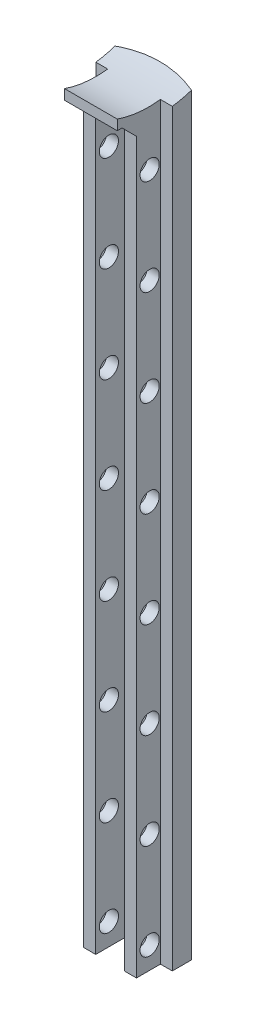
from build123d import *

# Parameters (mm, degrees)
EXTRUDE_1_DEPTH          = 150
SKETCH_2_R               = 2
CUT_EXTRUDE_1_DEPTH      = 21
EXTRUDE_2_DEPTH          = 5
PATTERN_LINEAR_1_COUNT   = 8
PATTERN_LINEAR_1_PITCH   = 20
EXTRUDE_3_DEPTH          = 5
CUT_EXTRUDE_3_DEPTH      = 18
CUT_EXTRUDE_3_DEPTH_BACK = 15
CHAMFER_1_SIZE           = 3
CHAMFER_2_SIZE           = 4
CHAMFER_2_SIZE2          = 6.92820323


with BuildPart() as part:
    # Sketch 1 → Extrude 1 (new body)
    with BuildSketch(Plane(origin=(0, 0, 0), x_dir=(1, 0, 0), z_dir=(0, 1, 0))):
        with BuildLine():
            Line((-17.806507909, 39.498815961), (-17.806507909, 35.498815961))
            Line((-17.806507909, 35.498815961), (-20.281662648, 35.498815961))
            Line((-20.281662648, 35.498815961), (-20.281662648, 30.498815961))
            Line((-20.281662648, 30.498815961), (-22.781662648, 30.498815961))
            Line((-22.781662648, 30.498815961), (-22.781662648, 36.998815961))
            Line((-22.781662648, 36.998815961), (-28.781662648, 36.998815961))
            Line((-28.781662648, 36.998815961), (-28.781662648, 30.498815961))
            Line((-28.781662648, 30.498815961), (-31.281662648, 30.498815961))
            Line((-31.281662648, 30.498815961), (-31.281662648, 35.498815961))
            Line((-31.281662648, 35.498815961), (-33.756817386, 35.498815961))
            Line((-33.756817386, 35.498815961), (-33.756817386, 39.498815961))
            ThreePointArc((-33.756817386, 39.498815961), (-25.781662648, 40.862630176), (-17.806507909, 39.498815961))
        make_face()
    extrude(amount=EXTRUDE_1_DEPTH)

    # Sketch 2 → Cut-Extrude 1 (cut)
    with BuildSketch(Plane.ZY.offset(31.281662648)):
        with Locations((-33.248815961, 4.598926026)):
            Circle(SKETCH_2_R)
    cut_extrude_1 = extrude(amount=-CUT_EXTRUDE_1_DEPTH, mode=Mode.SUBTRACT)

    # Sketch 4 → Extrude 2 (add)
    with BuildSketch(Plane(origin=(0, 150, 0), x_dir=(1, 0, 0), z_dir=(0, 1, 0))):
        with BuildLine():
            Line((-33.756817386, 39.498815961), (-33.756817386, 35.498815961))
            Line((-33.756817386, 35.498815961), (-31.281662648, 35.498815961))
            Line((-31.281662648, 35.498815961), (-31.281662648, 30.498815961))
            Line((-31.281662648, 30.498815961), (-28.781662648, 30.498815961))
            Line((-28.781662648, 30.498815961), (-28.781662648, 36.998815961))
            Line((-28.781662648, 36.998815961), (-22.781662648, 36.998815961))
            Line((-22.781662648, 36.998815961), (-22.781662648, 30.498815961))
            Line((-22.781662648, 30.498815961), (-20.281662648, 30.498815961))
            Line((-20.281662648, 30.498815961), (-20.281662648, 35.498815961))
            Line((-20.281662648, 35.498815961), (-17.806507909, 35.498815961))
            Line((-17.806507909, 35.498815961), (-17.806507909, 39.498815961))
            ThreePointArc((-17.806507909, 39.498815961), (-25.781662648, 40.862630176), (-33.756817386, 39.498815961))
        make_face()
    extrude(amount=EXTRUDE_2_DEPTH)

    # Pattern Linear 1: Cut-Extrude 1 ×8
    with Locations(*[(0, i * PATTERN_LINEAR_1_PITCH, 0) for i in range(1, PATTERN_LINEAR_1_COUNT)]):
        add(cut_extrude_1, mode=Mode.SUBTRACT)

    # Sketch 7 → Extrude 3 (add)
    with BuildSketch(Plane(origin=(0, 155, 0), x_dir=(1, 0, 0), z_dir=(0, 1, 0))):
        with BuildLine():
            Line((-31.281662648, 30.498815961), (-31.281662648, 26.498815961))
            Line((-31.281662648, 26.498815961), (-20.281662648, 26.498815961))
            Line((-20.281662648, 26.498815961), (-20.281662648, 30.498815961))
            Line((-20.281662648, 30.498815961), (-20.281662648, 35.498815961))
            Line((-20.281662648, 35.498815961), (-17.806507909, 35.498815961))
            Line((-17.806507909, 35.498815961), (-17.806507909, 39.498815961))
            ThreePointArc((-17.806507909, 39.498815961), (-25.781662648, 40.862630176), (-33.756817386, 39.498815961))
            Line((-33.756817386, 39.498815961), (-33.756817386, 35.498815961))
            Line((-33.756817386, 35.498815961), (-31.281662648, 35.498815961))
            Line((-31.281662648, 35.498815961), (-31.281662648, 30.498815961))
        make_face()
    extrude(amount=EXTRUDE_3_DEPTH)

    # Sketch 8 → Cut-Extrude 3 (cut, two sides: drawn at the far end of the back side and taken through both)
    with BuildSketch(Plane.ZY.offset(25.781662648).offset(-CUT_EXTRUDE_3_DEPTH_BACK)):
        with BuildLine():
            Line((-26.498815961, 157.107016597), (-26.498815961, 160))
            Line((-26.498815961, 160), (-40.862630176, 160))
            Line((-40.862630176, 160), (-40.862630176, 157.584621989))
            ThreePointArc((-40.862630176, 157.584621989), (-33.725105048, 156.011046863), (-26.498815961, 157.107016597))
        make_face()
    extrude(amount=CUT_EXTRUDE_3_DEPTH + CUT_EXTRUDE_3_DEPTH_BACK, mode=Mode.SUBTRACT)

    # Chamfer 1
    chamfer_1_edges = [part.edges().sort_by_distance(p)[0] for p in [
        (-30.031662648, 155, -30.498815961),
        (-21.531662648, 155, -30.498815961),
    ]]
    chamfer(chamfer_1_edges, length=CHAMFER_1_SIZE)

    # Chamfer 2
    chamfer_2_edges = [part.edges().sort_by_distance(p)[0] for p in [
        (-25.781662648, 155, -36.998815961),
    ]]
    chamfer_2_side = [part.faces().sort_by_distance(p)[0] for p in [
        (-25.781662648, 77.5, -36.998815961),
    ]]
    chamfer(chamfer_2_edges, length=CHAMFER_2_SIZE, length2=CHAMFER_2_SIZE2, reference=chamfer_2_side[0])


solid = part.part
